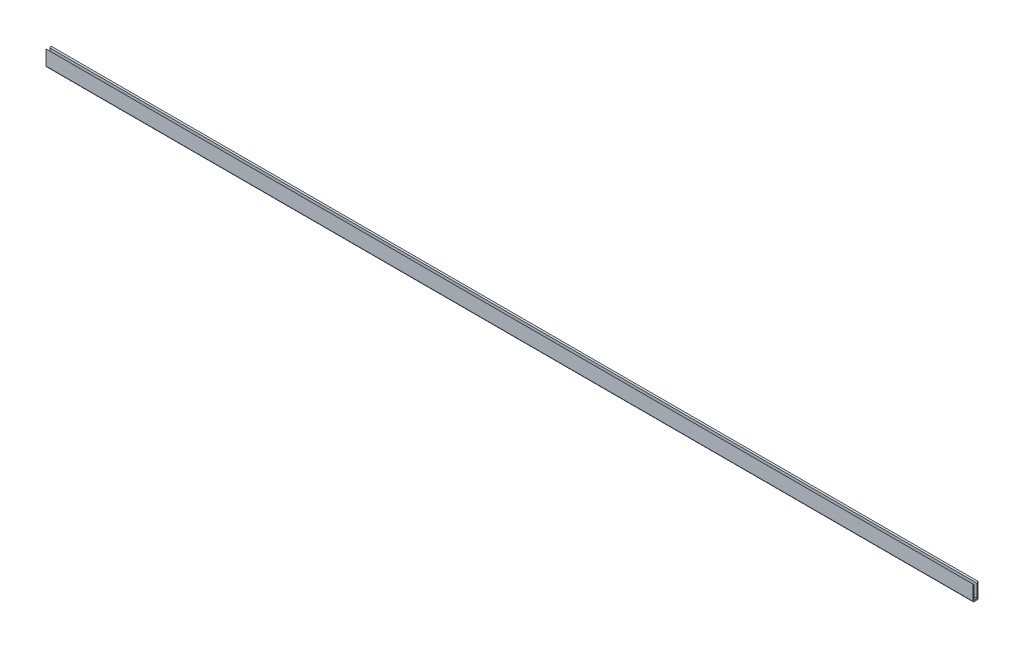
ISO-10303-21;
HEADER;
FILE_DESCRIPTION(('STEP AP214'),'2;1');
FILE_NAME('part.step','',(''),(''),'','','');
FILE_SCHEMA(('AUTOMOTIVE_DESIGN { 1 0 10303 214 1 1 1 1 }'));
ENDSEC;
DATA;
#1=APPLICATION_CONTEXT('core data for automotive mechanical design processes');
#2=APPLICATION_PROTOCOL_DEFINITION('international standard','automotive_design',2000,#1);
#3=PRODUCT_CONTEXT('',#1,'mechanical');
#4=PRODUCT('Part','Part','',(#3));
#5=PRODUCT_RELATED_PRODUCT_CATEGORY('part','',(#4));
#6=PRODUCT_DEFINITION_FORMATION('','',#4);
#7=PRODUCT_DEFINITION_CONTEXT('part definition',#1,'design');
#8=PRODUCT_DEFINITION('design','',#6,#7);
#9=PRODUCT_DEFINITION_SHAPE('','',#8);
#10=(LENGTH_UNIT() NAMED_UNIT(*) SI_UNIT(.MILLI.,.METRE.));
#11=(NAMED_UNIT(*) PLANE_ANGLE_UNIT() SI_UNIT($,.RADIAN.));
#12=(NAMED_UNIT(*) SI_UNIT($,.STERADIAN.) SOLID_ANGLE_UNIT());
#13=UNCERTAINTY_MEASURE_WITH_UNIT(LENGTH_MEASURE(1.E-05),#10,'distance_accuracy_value','');
#14=(GEOMETRIC_REPRESENTATION_CONTEXT(3) GLOBAL_UNCERTAINTY_ASSIGNED_CONTEXT((#13)) GLOBAL_UNIT_ASSIGNED_CONTEXT((#10,
#11,#12)) REPRESENTATION_CONTEXT('',''));
#15=CARTESIAN_POINT('',(0.,0.,0.));
#16=DIRECTION('',(0.,0.,1.));
#17=DIRECTION('',(1.,0.,0.));
#18=AXIS2_PLACEMENT_3D('',#15,#16,#17);
#19=CARTESIAN_POINT('',(1000.,17.,2.65000000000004));
#20=DIRECTION('',(0.,-0.707106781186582,0.707106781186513));
#21=DIRECTION('',(0.,-0.707106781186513,-0.707106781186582));
#22=AXIS2_PLACEMENT_3D('',#19,#20,#21);
#23=PLANE('',#22);
#24=DIRECTION('',(0.,0.707106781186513,0.707106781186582));
#25=VECTOR('',#24,1.);
#26=CARTESIAN_POINT('',(0.,17.,2.65000000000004));
#27=LINE('',#26,#25);
#28=CARTESIAN_POINT('',(0.,15.85,1.49999999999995));
#29=VERTEX_POINT('',#28);
#30=CARTESIAN_POINT('',(0.,17.,2.65000000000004));
#31=VERTEX_POINT('',#30);
#32=EDGE_CURVE('E141',#29,#31,#27,.T.);
#33=ORIENTED_EDGE('',*,*,#32,.T.);
#34=DIRECTION('',(-1.,0.,0.));
#35=VECTOR('',#34,1.);
#36=CARTESIAN_POINT('',(1000.,17.,2.65000000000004));
#37=LINE('',#36,#35);
#38=CARTESIAN_POINT('',(1000.,17.,2.65000000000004));
#39=VERTEX_POINT('',#38);
#40=EDGE_CURVE('E11',#39,#31,#37,.T.);
#41=ORIENTED_EDGE('',*,*,#40,.F.);
#42=DIRECTION('',(0.,0.707106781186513,0.707106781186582));
#43=VECTOR('',#42,1.);
#44=CARTESIAN_POINT('',(1000.,17.,2.65000000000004));
#45=LINE('',#44,#43);
#46=CARTESIAN_POINT('',(1000.,15.85,1.49999999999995));
#47=VERTEX_POINT('',#46);
#48=EDGE_CURVE('E159',#47,#39,#45,.T.);
#49=ORIENTED_EDGE('',*,*,#48,.F.);
#50=DIRECTION('',(-1.,0.,0.));
#51=VECTOR('',#50,1.);
#52=CARTESIAN_POINT('',(1000.,15.85,1.49999999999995));
#53=LINE('',#52,#51);
#54=EDGE_CURVE('E137',#47,#29,#53,.T.);
#55=ORIENTED_EDGE('',*,*,#54,.T.);
#56=EDGE_LOOP('',(#33,#41,#49,#55));
#57=FACE_BOUND('',#56,.T.);
#58=ADVANCED_FACE('F33',(#57),#23,.F.);
#59=CARTESIAN_POINT('',(1000.,17.,2.65000000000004));
#60=DIRECTION('',(0.,0.,-1.));
#61=DIRECTION('',(-1.,0.,0.));
#62=AXIS2_PLACEMENT_3D('',#59,#60,#61);
#63=PLANE('',#62);
#64=DIRECTION('',(0.,-1.,0.));
#65=VECTOR('',#64,1.);
#66=CARTESIAN_POINT('',(0.,17.,2.65000000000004));
#67=LINE('',#66,#65);
#68=CARTESIAN_POINT('',(0.,1.,2.65000000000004));
#69=VERTEX_POINT('',#68);
#70=EDGE_CURVE('E144',#31,#69,#67,.T.);
#71=ORIENTED_EDGE('',*,*,#70,.T.);
#72=DIRECTION('',(-1.,0.,0.));
#73=VECTOR('',#72,1.);
#74=CARTESIAN_POINT('',(1000.,1.,2.65000000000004));
#75=LINE('',#74,#73);
#76=CARTESIAN_POINT('',(1000.,1.,2.65000000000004));
#77=VERTEX_POINT('',#76);
#78=EDGE_CURVE('E41',#77,#69,#75,.T.);
#79=ORIENTED_EDGE('',*,*,#78,.F.);
#80=DIRECTION('',(0.,-1.,0.));
#81=VECTOR('',#80,1.);
#82=CARTESIAN_POINT('',(1000.,17.,2.65000000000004));
#83=LINE('',#82,#81);
#84=EDGE_CURVE('E98',#39,#77,#83,.T.);
#85=ORIENTED_EDGE('',*,*,#84,.F.);
#86=ORIENTED_EDGE('',*,*,#40,.T.);
#87=EDGE_LOOP('',(#71,#79,#85,#86));
#88=FACE_BOUND('',#87,.T.);
#89=ADVANCED_FACE('F208',(#88),#63,.F.);
#90=CARTESIAN_POINT('',(1000.,1.,1.65000000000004));
#91=DIRECTION('',(-1.,0.,0.));
#92=DIRECTION('',(0.,0.,1.));
#93=AXIS2_PLACEMENT_3D('',#90,#91,#92);
#94=CYLINDRICAL_SURFACE('',#93,1.);
#95=CARTESIAN_POINT('',(0.,1.,1.65000000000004));
#96=DIRECTION('',(1.,0.,0.));
#97=DIRECTION('',(0.,0.,-1.));
#98=AXIS2_PLACEMENT_3D('',#95,#96,#97);
#99=CIRCLE('',#98,1.);
#100=CARTESIAN_POINT('',(0.,0.,1.65000000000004));
#101=VERTEX_POINT('',#100);
#102=EDGE_CURVE('E146',#69,#101,#99,.T.);
#103=ORIENTED_EDGE('',*,*,#102,.T.);
#104=DIRECTION('',(-1.,0.,0.));
#105=VECTOR('',#104,1.);
#106=CARTESIAN_POINT('',(1000.,0.,1.65000000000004));
#107=LINE('',#106,#105);
#108=CARTESIAN_POINT('',(1000.,0.,1.65000000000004));
#109=VERTEX_POINT('',#108);
#110=EDGE_CURVE('E172',#109,#101,#107,.T.);
#111=ORIENTED_EDGE('',*,*,#110,.F.);
#112=CARTESIAN_POINT('',(1000.,1.,1.65000000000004));
#113=DIRECTION('',(1.,0.,0.));
#114=DIRECTION('',(0.,0.,-1.));
#115=AXIS2_PLACEMENT_3D('',#112,#113,#114);
#116=CIRCLE('',#115,1.);
#117=EDGE_CURVE('E180',#77,#109,#116,.T.);
#118=ORIENTED_EDGE('',*,*,#117,.F.);
#119=ORIENTED_EDGE('',*,*,#78,.T.);
#120=EDGE_LOOP('',(#103,#111,#118,#119));
#121=FACE_BOUND('',#120,.T.);
#122=ADVANCED_FACE('F178',(#121),#94,.T.);
#123=CARTESIAN_POINT('',(1000.,0.,1.65000000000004));
#124=DIRECTION('',(0.,1.,0.));
#125=DIRECTION('',(0.,0.,1.));
#126=AXIS2_PLACEMENT_3D('',#123,#124,#125);
#127=PLANE('',#126);
#128=DIRECTION('',(0.,0.,-1.));
#129=VECTOR('',#128,1.);
#130=CARTESIAN_POINT('',(0.,0.,1.65000000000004));
#131=LINE('',#130,#129);
#132=CARTESIAN_POINT('',(0.,0.,-1.65000000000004));
#133=VERTEX_POINT('',#132);
#134=EDGE_CURVE('E148',#101,#133,#131,.T.);
#135=ORIENTED_EDGE('',*,*,#134,.T.);
#136=DIRECTION('',(-1.,0.,0.));
#137=VECTOR('',#136,1.);
#138=CARTESIAN_POINT('',(1000.,0.,-1.65000000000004));
#139=LINE('',#138,#137);
#140=CARTESIAN_POINT('',(1000.,0.,-1.65000000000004));
#141=VERTEX_POINT('',#140);
#142=EDGE_CURVE('E169',#141,#133,#139,.T.);
#143=ORIENTED_EDGE('',*,*,#142,.F.);
#144=DIRECTION('',(0.,0.,-1.));
#145=VECTOR('',#144,1.);
#146=CARTESIAN_POINT('',(1000.,0.,1.65000000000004));
#147=LINE('',#146,#145);
#148=EDGE_CURVE('E198',#109,#141,#147,.T.);
#149=ORIENTED_EDGE('',*,*,#148,.F.);
#150=ORIENTED_EDGE('',*,*,#110,.T.);
#151=EDGE_LOOP('',(#135,#143,#149,#150));
#152=FACE_BOUND('',#151,.T.);
#153=ADVANCED_FACE('F189',(#152),#127,.F.);
#154=CARTESIAN_POINT('',(1000.,1.,-1.65000000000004));
#155=DIRECTION('',(-1.,0.,0.));
#156=DIRECTION('',(0.,0.,1.));
#157=AXIS2_PLACEMENT_3D('',#154,#155,#156);
#158=CYLINDRICAL_SURFACE('',#157,0.999999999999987);
#159=CARTESIAN_POINT('',(0.,1.,-1.65000000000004));
#160=DIRECTION('',(1.,0.,0.));
#161=DIRECTION('',(0.,0.,-1.));
#162=AXIS2_PLACEMENT_3D('',#159,#160,#161);
#163=CIRCLE('',#162,0.999999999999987);
#164=CARTESIAN_POINT('',(0.,1.,-2.65000000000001));
#165=VERTEX_POINT('',#164);
#166=EDGE_CURVE('E150',#133,#165,#163,.T.);
#167=ORIENTED_EDGE('',*,*,#166,.T.);
#168=DIRECTION('',(-1.,0.,0.));
#169=VECTOR('',#168,1.);
#170=CARTESIAN_POINT('',(1000.,1.,-2.65000000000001));
#171=LINE('',#170,#169);
#172=CARTESIAN_POINT('',(1000.,1.,-2.65000000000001));
#173=VERTEX_POINT('',#172);
#174=EDGE_CURVE('E166',#173,#165,#171,.T.);
#175=ORIENTED_EDGE('',*,*,#174,.F.);
#176=CARTESIAN_POINT('',(1000.,1.,-1.65000000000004));
#177=DIRECTION('',(1.,0.,0.));
#178=DIRECTION('',(0.,0.,-1.));
#179=AXIS2_PLACEMENT_3D('',#176,#177,#178);
#180=CIRCLE('',#179,0.999999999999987);
#181=EDGE_CURVE('E195',#141,#173,#180,.T.);
#182=ORIENTED_EDGE('',*,*,#181,.F.);
#183=ORIENTED_EDGE('',*,*,#142,.T.);
#184=EDGE_LOOP('',(#167,#175,#182,#183));
#185=FACE_BOUND('',#184,.T.);
#186=ADVANCED_FACE('F193',(#185),#158,.T.);
#187=CARTESIAN_POINT('',(1000.,17.,-2.65000000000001));
#188=DIRECTION('',(0.,0.,1.));
#189=DIRECTION('',(1.,0.,0.));
#190=AXIS2_PLACEMENT_3D('',#187,#188,#189);
#191=PLANE('',#190);
#192=DIRECTION('',(0.,1.,0.));
#193=VECTOR('',#192,1.);
#194=CARTESIAN_POINT('',(0.,17.,-2.65000000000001));
#195=LINE('',#194,#193);
#196=CARTESIAN_POINT('',(0.,17.,-2.65000000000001));
#197=VERTEX_POINT('',#196);
#198=EDGE_CURVE('E152',#165,#197,#195,.T.);
#199=ORIENTED_EDGE('',*,*,#198,.T.);
#200=DIRECTION('',(-1.,0.,0.));
#201=VECTOR('',#200,1.);
#202=CARTESIAN_POINT('',(1000.,17.,-2.65000000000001));
#203=LINE('',#202,#201);
#204=CARTESIAN_POINT('',(1000.,17.,-2.65000000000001));
#205=VERTEX_POINT('',#204);
#206=EDGE_CURVE('E163',#205,#197,#203,.T.);
#207=ORIENTED_EDGE('',*,*,#206,.F.);
#208=DIRECTION('',(0.,1.,0.));
#209=VECTOR('',#208,1.);
#210=CARTESIAN_POINT('',(1000.,17.,-2.65000000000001));
#211=LINE('',#210,#209);
#212=EDGE_CURVE('E197',#173,#205,#211,.T.);
#213=ORIENTED_EDGE('',*,*,#212,.F.);
#214=ORIENTED_EDGE('',*,*,#174,.T.);
#215=EDGE_LOOP('',(#199,#207,#213,#214));
#216=FACE_BOUND('',#215,.T.);
#217=ADVANCED_FACE('F220',(#216),#191,.F.);
#218=CARTESIAN_POINT('',(1000.,17.,-2.65000000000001));
#219=DIRECTION('',(0.,-0.70710678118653,-0.707106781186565));
#220=DIRECTION('',(0.,0.707106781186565,-0.70710678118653));
#221=AXIS2_PLACEMENT_3D('',#218,#219,#220);
#222=PLANE('',#221);
#223=DIRECTION('',(0.,-0.707106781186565,0.70710678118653));
#224=VECTOR('',#223,1.);
#225=CARTESIAN_POINT('',(0.,17.,-2.65000000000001));
#226=LINE('',#225,#224);
#227=CARTESIAN_POINT('',(0.,15.85,-1.50000000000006));
#228=VERTEX_POINT('',#227);
#229=EDGE_CURVE('E154',#197,#228,#226,.T.);
#230=ORIENTED_EDGE('',*,*,#229,.T.);
#231=DIRECTION('',(-1.,0.,0.));
#232=VECTOR('',#231,1.);
#233=CARTESIAN_POINT('',(1000.,15.85,-1.50000000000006));
#234=LINE('',#233,#232);
#235=CARTESIAN_POINT('',(1000.,15.85,-1.50000000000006));
#236=VERTEX_POINT('',#235);
#237=EDGE_CURVE('E132',#236,#228,#234,.T.);
#238=ORIENTED_EDGE('',*,*,#237,.F.);
#239=DIRECTION('',(0.,-0.707106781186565,0.70710678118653));
#240=VECTOR('',#239,1.);
#241=CARTESIAN_POINT('',(1000.,17.,-2.65000000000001));
#242=LINE('',#241,#240);
#243=EDGE_CURVE('E123',#205,#236,#242,.T.);
#244=ORIENTED_EDGE('',*,*,#243,.F.);
#245=ORIENTED_EDGE('',*,*,#206,.T.);
#246=EDGE_LOOP('',(#230,#238,#244,#245));
#247=FACE_BOUND('',#246,.T.);
#248=ADVANCED_FACE('F223',(#247),#222,.F.);
#249=CARTESIAN_POINT('',(1000.,15.85,-1.50000000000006));
#250=DIRECTION('',(0.,0.,-1.));
#251=DIRECTION('',(0.,1.,0.));
#252=AXIS2_PLACEMENT_3D('',#249,#250,#251);
#253=PLANE('',#252);
#254=DIRECTION('',(0.,-1.,0.));
#255=VECTOR('',#254,1.);
#256=CARTESIAN_POINT('',(0.,15.85,-1.50000000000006));
#257=LINE('',#256,#255);
#258=CARTESIAN_POINT('',(0.,1.5,-1.49999999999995));
#259=VERTEX_POINT('',#258);
#260=EDGE_CURVE('E131',#228,#259,#257,.T.);
#261=ORIENTED_EDGE('',*,*,#260,.T.);
#262=DIRECTION('',(-1.,0.,0.));
#263=VECTOR('',#262,1.);
#264=CARTESIAN_POINT('',(1000.,1.5,-1.49999999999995));
#265=LINE('',#264,#263);
#266=CARTESIAN_POINT('',(1000.,1.5,-1.49999999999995));
#267=VERTEX_POINT('',#266);
#268=EDGE_CURVE('E128',#267,#259,#265,.T.);
#269=ORIENTED_EDGE('',*,*,#268,.F.);
#270=DIRECTION('',(0.,-1.,0.));
#271=VECTOR('',#270,1.);
#272=CARTESIAN_POINT('',(1000.,15.85,-1.50000000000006));
#273=LINE('',#272,#271);
#274=EDGE_CURVE('E117',#236,#267,#273,.T.);
#275=ORIENTED_EDGE('',*,*,#274,.F.);
#276=ORIENTED_EDGE('',*,*,#237,.T.);
#277=EDGE_LOOP('',(#261,#269,#275,#276));
#278=FACE_BOUND('',#277,.T.);
#279=ADVANCED_FACE('F129',(#278),#253,.F.);
#280=CARTESIAN_POINT('',(1000.,1.5,1.49999999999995));
#281=DIRECTION('',(0.,-1.,0.));
#282=DIRECTION('',(0.,0.,-1.));
#283=AXIS2_PLACEMENT_3D('',#280,#281,#282);
#284=PLANE('',#283);
#285=DIRECTION('',(0.,0.,1.));
#286=VECTOR('',#285,1.);
#287=CARTESIAN_POINT('',(0.,1.5,1.49999999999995));
#288=LINE('',#287,#286);
#289=CARTESIAN_POINT('',(0.,1.5,1.49999999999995));
#290=VERTEX_POINT('',#289);
#291=EDGE_CURVE('E84',#259,#290,#288,.T.);
#292=ORIENTED_EDGE('',*,*,#291,.T.);
#293=DIRECTION('',(-1.,0.,0.));
#294=VECTOR('',#293,1.);
#295=CARTESIAN_POINT('',(1000.,1.5,1.49999999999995));
#296=LINE('',#295,#294);
#297=CARTESIAN_POINT('',(1000.,1.5,1.49999999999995));
#298=VERTEX_POINT('',#297);
#299=EDGE_CURVE('E133',#298,#290,#296,.T.);
#300=ORIENTED_EDGE('',*,*,#299,.F.);
#301=DIRECTION('',(0.,0.,1.));
#302=VECTOR('',#301,1.);
#303=CARTESIAN_POINT('',(1000.,1.5,1.49999999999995));
#304=LINE('',#303,#302);
#305=EDGE_CURVE('E121',#267,#298,#304,.T.);
#306=ORIENTED_EDGE('',*,*,#305,.F.);
#307=ORIENTED_EDGE('',*,*,#268,.T.);
#308=EDGE_LOOP('',(#292,#300,#306,#307));
#309=FACE_BOUND('',#308,.T.);
#310=ADVANCED_FACE('F135',(#309),#284,.F.);
#311=CARTESIAN_POINT('',(1000.,15.85,1.49999999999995));
#312=DIRECTION('',(0.,0.,1.));
#313=DIRECTION('',(1.,0.,0.));
#314=AXIS2_PLACEMENT_3D('',#311,#312,#313);
#315=PLANE('',#314);
#316=DIRECTION('',(0.,1.,0.));
#317=VECTOR('',#316,1.);
#318=CARTESIAN_POINT('',(0.,15.85,1.49999999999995));
#319=LINE('',#318,#317);
#320=EDGE_CURVE('E90',#290,#29,#319,.T.);
#321=ORIENTED_EDGE('',*,*,#320,.T.);
#322=ORIENTED_EDGE('',*,*,#54,.F.);
#323=DIRECTION('',(0.,1.,0.));
#324=VECTOR('',#323,1.);
#325=CARTESIAN_POINT('',(1000.,15.85,1.49999999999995));
#326=LINE('',#325,#324);
#327=EDGE_CURVE('E49',#298,#47,#326,.T.);
#328=ORIENTED_EDGE('',*,*,#327,.F.);
#329=ORIENTED_EDGE('',*,*,#299,.T.);
#330=EDGE_LOOP('',(#321,#322,#328,#329));
#331=FACE_BOUND('',#330,.T.);
#332=ADVANCED_FACE('F232',(#331),#315,.F.);
#333=CARTESIAN_POINT('',(1000.,1.,-1.65000000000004));
#334=DIRECTION('',(1.,0.,0.));
#335=DIRECTION('',(0.,0.,-1.));
#336=AXIS2_PLACEMENT_3D('',#333,#334,#335);
#337=PLANE('',#336);
#338=ORIENTED_EDGE('',*,*,#48,.T.);
#339=ORIENTED_EDGE('',*,*,#84,.T.);
#340=ORIENTED_EDGE('',*,*,#117,.T.);
#341=ORIENTED_EDGE('',*,*,#148,.T.);
#342=ORIENTED_EDGE('',*,*,#181,.T.);
#343=ORIENTED_EDGE('',*,*,#212,.T.);
#344=ORIENTED_EDGE('',*,*,#243,.T.);
#345=ORIENTED_EDGE('',*,*,#274,.T.);
#346=ORIENTED_EDGE('',*,*,#305,.T.);
#347=ORIENTED_EDGE('',*,*,#327,.T.);
#348=EDGE_LOOP('',(#338,#339,#340,#341,#342,#343,#344,#345,#346,#347));
#349=FACE_BOUND('',#348,.T.);
#350=ADVANCED_FACE('F119',(#349),#337,.T.);
#351=CARTESIAN_POINT('',(0.,1.,-1.65000000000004));
#352=DIRECTION('',(1.,0.,0.));
#353=DIRECTION('',(0.,0.,-1.));
#354=AXIS2_PLACEMENT_3D('',#351,#352,#353);
#355=PLANE('',#354);
#356=ORIENTED_EDGE('',*,*,#32,.F.);
#357=ORIENTED_EDGE('',*,*,#320,.F.);
#358=ORIENTED_EDGE('',*,*,#291,.F.);
#359=ORIENTED_EDGE('',*,*,#260,.F.);
#360=ORIENTED_EDGE('',*,*,#229,.F.);
#361=ORIENTED_EDGE('',*,*,#198,.F.);
#362=ORIENTED_EDGE('',*,*,#166,.F.);
#363=ORIENTED_EDGE('',*,*,#134,.F.);
#364=ORIENTED_EDGE('',*,*,#102,.F.);
#365=ORIENTED_EDGE('',*,*,#70,.F.);
#366=EDGE_LOOP('',(#356,#357,#358,#359,#360,#361,#362,#363,#364,#365));
#367=FACE_BOUND('',#366,.T.);
#368=ADVANCED_FACE('F184',(#367),#355,.F.);
#369=CLOSED_SHELL('',(#58,#89,#122,#153,#186,#217,#248,#279,#310,#332,#350,#368));
#370=MANIFOLD_SOLID_BREP('B2',#369);
#371=ADVANCED_BREP_SHAPE_REPRESENTATION('',(#18,#370),#14);
#372=SHAPE_DEFINITION_REPRESENTATION(#9,#371);
ENDSEC;
END-ISO-10303-21;
